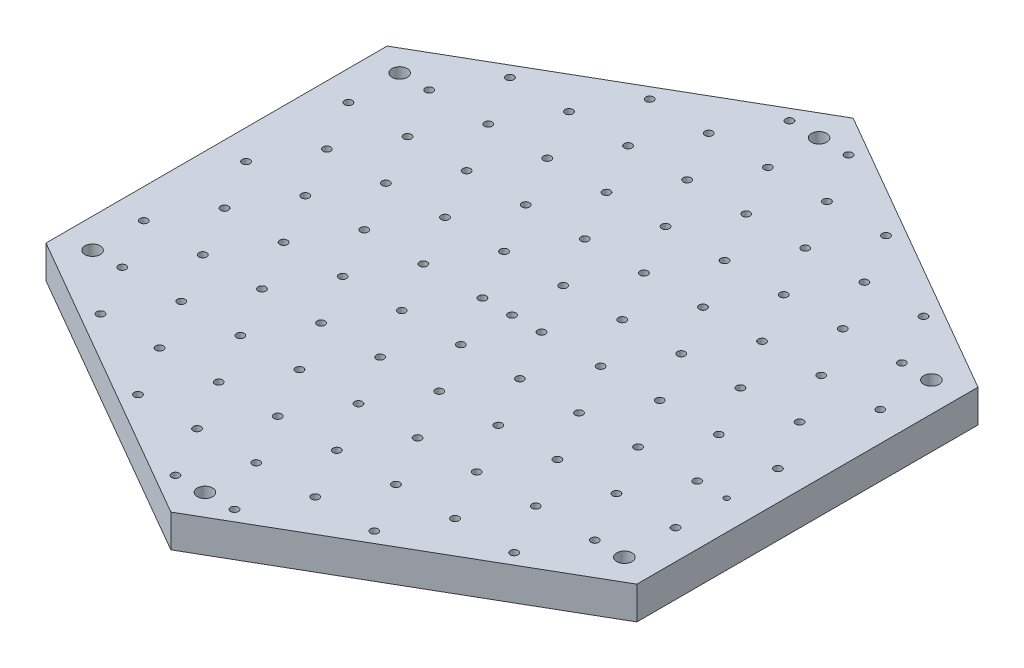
from build123d import *

# Parameters (mm, degrees)
BOSS_EXTRUDE1_DEPTH   = 6
SKETCH2_R             = 0.7
CUT_EXTRUDE1_DEPTH    = 83.897150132
BOSS_EXTRUDE2_DEPTH   = 0.34
BOSS_EXTRUDE3_DEPTH   = 0.34
BOSS_EXTRUDE4_DEPTH   = 0.34
SKETCH4_R             = 1.4
CUT_EXTRUDE3_DEPTH    = 83.897150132
SKETCH8_R             = 0.7
CUT_EXTRUDE4_DEPTH    = 83.897150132
SKETCH9_R             = 0.7
CUT_EXTRUDE5_DEPTH    = 83.897150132
SKETCH10_R            = 0.7
CUT_EXTRUDE6_DEPTH    = 83.897150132
SKETCH11_R            = 0.7
CUT_EXTRUDE7_DEPTH    = 83.897150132
SKETCH12_R            = 0.7
CUT_EXTRUDE8_DEPTH    = 83.897150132
SKETCH13_R            = 0.7
CUT_EXTRUDE9_DEPTH    = 83.897150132
SKETCH14_R            = 0.7
CUT_EXTRUDE10_DEPTH   = 83.897150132
SKETCH15_R            = 0.7
CUT_EXTRUDE11_DEPTH   = 83.897150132
SKETCH16_R            = 0.7
CUT_EXTRUDE12_DEPTH   = 83.897150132
SKETCH17_R            = 0.7
CUT_EXTRUDE13_DEPTH   = 83.897150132
LPATTERN3_COUNT       = 5
LPATTERN3_PITCH       = 10.8253
LPATTERN3_COL_COUNT   = 6
LPATTERN3_COL_PITCH   = 10.8253
LPATTERN4_COUNT       = 6
LPATTERN4_PITCH       = 10.8253
LPATTERN4_COL_COUNT   = 5
LPATTERN4_COL_PITCH   = 10.8253
LPATTERN5_COUNT       = 4
LPATTERN5_PITCH       = 10.8253
LPATTERN5_COL_COUNT   = 7
LPATTERN5_COL_PITCH   = 10.8253
LPATTERN6_COUNT       = 3
LPATTERN6_PITCH       = 10.8253
LPATTERN6_COL_COUNT   = 7
LPATTERN6_COL_PITCH   = 10.8253
LPATTERN7_COUNT       = 6
LPATTERN7_PITCH       = 10.8253
LPATTERN8_COUNT       = 5
LPATTERN8_PITCH       = 10.8253
LPATTERN9_COUNT       = 5
LPATTERN9_PITCH       = 10.8253
LPATTERN9_COL_COUNT   = 2
LPATTERN9_COL_PITCH   = 10.8253
LPATTERN10_COUNT      = 4
LPATTERN10_PITCH      = 10.8253
LPATTERN10_COL_COUNT  = 3
LPATTERN10_COL_PITCH  = 10.8253
LPATTERN11_COUNT      = 4
LPATTERN11_PITCH      = 10.8253
LPATTERN11_COL_COUNT  = 3
LPATTERN11_COL_PITCH  = 10.8253
LPATTERN12_COUNT      = 5
LPATTERN12_PITCH      = 10.8253
LPATTERN13_COUNT      = 6
LPATTERN13_PITCH      = 10.8253
LPATTERN14_COUNT      = 6
LPATTERN14_PITCH      = 10.8253
LPATTERN14_COUNT_DIR2 = 5
LPATTERN14_PITCH_DIR2 = 10.8253
LPATTERN15_COUNT      = 7
LPATTERN15_PITCH      = 10.8253
LPATTERN15_COUNT_DIR2 = 4
LPATTERN15_PITCH_DIR2 = 10.8253
LPATTERN16_COUNT      = 7
LPATTERN16_PITCH      = 10.8253
LPATTERN16_COUNT_DIR2 = 3
LPATTERN16_PITCH_DIR2 = 10.8253
LPATTERN17_COUNT      = 6
LPATTERN17_PITCH      = 10.8253
LPATTERN18_COUNT      = 5
LPATTERN18_PITCH      = 10.8253
LPATTERN19_COUNT      = 4
LPATTERN19_PITCH      = 10.8253
LPATTERN20_COUNT      = 3
LPATTERN20_PITCH      = 10.8253
SKETCH18_R            = 0.5
CUT_EXTRUDE14_DEPTH   = 83.897150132


with BuildPart() as part:
    # Sketch1 → Boss-Extrude1 (new body)
    with BuildSketch(Plane(origin=(0, 0, 0), x_dir=(1, 0, 0), z_dir=(0, 1, 0))):
        Polygon((0, 62.5), (-54.126587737, 31.25), (-54.126587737, -31.25), (0, -62.5), (54.126587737, -31.25), (54.126587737, 31.25), align=None)
    extrude(amount=BOSS_EXTRUDE1_DEPTH)

    # Sketch2 → Cut-Extrude1 (cut, through all)
    with BuildSketch(Plane(origin=(0, 6, 0), x_dir=(1, 0, 0), z_dir=(0, 1, 0))):
        with Locations(Location((0, 0, 0), (0, 0, 270))):
            Circle(SKETCH2_R)
    extrude(amount=-CUT_EXTRUDE1_DEPTH, mode=Mode.SUBTRACT)

    # Sketch5 → Boss-Extrude2 (add)
    with BuildSketch(Plane(origin=(0, 6, 0), x_dir=(1, 0, 0), z_dir=(0, 1, 0))):
        Polygon((-54.126587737, 26.862137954), (3.8, 60.306068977), (0, 62.5), (-54.126587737, 31.25), align=None)
    extrude(amount=-BOSS_EXTRUDE2_DEPTH)

    # Sketch6 → Boss-Extrude3 (add)
    with BuildSketch(Plane(origin=(0, 6, 0), x_dir=(1, 0, 0), z_dir=(0, 1, 0))):
        Polygon((54.126587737, 31.25), (54.126587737, 26.862137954), (-3.8, 60.306068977), (0, 62.5), align=None)
    extrude(amount=-BOSS_EXTRUDE3_DEPTH)

    # Sketch7 → Boss-Extrude4 (add)
    with BuildSketch(Plane(origin=(0, 6, 0), x_dir=(1, 0, 0), z_dir=(0, 1, 0))):
        Polygon((-54.126587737, -31.25), (-54.126587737, -26.862137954), (0, -58.112137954), (54.126587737, -26.862137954), (54.126587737, -31.25), (0, -62.5), align=None)
    extrude(amount=-BOSS_EXTRUDE4_DEPTH)

    # Sketch4 → Cut-Extrude3 (cut, through all)
    with BuildSketch(Plane(origin=(0, 6, 0), x_dir=(1, 0, 0), z_dir=(0, 1, 0))):
        with Locations(Location((0, 56.253070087, 0), (0, 0, 270))):
            Circle(SKETCH4_R)
        with Locations(Location((-48.713928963, 28.125, 0), (0, 0, 270))):
            Circle(SKETCH4_R)
        with Locations(Location((-48.716587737, -28.126535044, 0), (0, 0, 270))):
            Circle(SKETCH4_R)
        with Locations(Location((0, -56.253070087, 0), (0, 0, 270))):
            Circle(SKETCH4_R)
        with Locations(Location((48.716587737, -28.126535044, 0), (0, 0, 270))):
            Circle(SKETCH4_R)
        with Locations(Location((48.716587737, 28.126535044, 0), (0, 0, 270))):
            Circle(SKETCH4_R)
    extrude(amount=-CUT_EXTRUDE3_DEPTH, mode=Mode.SUBTRACT)

    # Sketch8 → Cut-Extrude4 (cut, through all)
    with BuildSketch(Plane(origin=(0, 6, 0), x_dir=(1, 0, 0), z_dir=(0, 1, 0))):
        with Locations(Location((5.41265, 0, 0), (0, 0, 270))):
            Circle(SKETCH8_R)
    cut_extrude4 = extrude(amount=-CUT_EXTRUDE4_DEPTH, mode=Mode.SUBTRACT)

    # Sketch9 → Cut-Extrude5 (cut, through all)
    with BuildSketch(Plane(origin=(0, 6, 0), x_dir=(1, 0, 0), z_dir=(0, 1, 0))):
        with Locations(Location((16.23795, 0, 0), (0, 0, 270))):
            Circle(SKETCH9_R)
    cut_extrude5 = extrude(amount=-CUT_EXTRUDE5_DEPTH, mode=Mode.SUBTRACT)

    # Sketch10 → Cut-Extrude6 (cut, through all)
    with BuildSketch(Plane(origin=(0, 6, 0), x_dir=(1, 0, 0), z_dir=(0, 1, 0))):
        with Locations(Location((27.06325, 0, 0), (0, 0, 270))):
            Circle(SKETCH10_R)
    cut_extrude6 = extrude(amount=-CUT_EXTRUDE6_DEPTH, mode=Mode.SUBTRACT)

    # Sketch11 → Cut-Extrude7 (cut, through all)
    with BuildSketch(Plane(origin=(0, 6, 0), x_dir=(1, 0, 0), z_dir=(0, 1, 0))):
        with Locations(Location((37.88855, 0, 0), (0, 0, 270))):
            Circle(SKETCH11_R)
    cut_extrude7 = extrude(amount=-CUT_EXTRUDE7_DEPTH, mode=Mode.SUBTRACT)

    # Sketch12 → Cut-Extrude8 (cut, through all)
    with BuildSketch(Plane(origin=(0, 6, 0), x_dir=(1, 0, 0), z_dir=(0, 1, 0))):
        with Locations(Location((48.71385, 0, 0), (0, 0, 270))):
            Circle(SKETCH12_R)
    cut_extrude8 = extrude(amount=-CUT_EXTRUDE8_DEPTH, mode=Mode.SUBTRACT)

    # Sketch13 → Cut-Extrude9 (cut, through all)
    with BuildSketch(Plane(origin=(0, 6, 0), x_dir=(1, 0, 0), z_dir=(0, 1, 0))):
        with Locations(Location((-5.41265, 0, 0), (0, 0, 270))):
            Circle(SKETCH13_R)
    cut_extrude9 = extrude(amount=-CUT_EXTRUDE9_DEPTH, mode=Mode.SUBTRACT)

    # Sketch14 → Cut-Extrude10 (cut, through all)
    with BuildSketch(Plane(origin=(0, 6, 0), x_dir=(1, 0, 0), z_dir=(0, 1, 0))):
        with Locations(Location((-16.23795, 0, 0), (0, 0, 270))):
            Circle(SKETCH14_R)
    cut_extrude10 = extrude(amount=-CUT_EXTRUDE10_DEPTH, mode=Mode.SUBTRACT)

    # Sketch15 → Cut-Extrude11 (cut, through all)
    with BuildSketch(Plane(origin=(0, 6, 0), x_dir=(1, 0, 0), z_dir=(0, 1, 0))):
        with Locations(Location((-27.06325, 0, 0), (0, 0, 270))):
            Circle(SKETCH15_R)
    cut_extrude11 = extrude(amount=-CUT_EXTRUDE11_DEPTH, mode=Mode.SUBTRACT)

    # Sketch16 → Cut-Extrude12 (cut, through all)
    with BuildSketch(Plane(origin=(0, 6, 0), x_dir=(1, 0, 0), z_dir=(0, 1, 0))):
        with Locations(Location((-37.88855, 0, 0), (0, 0, 270))):
            Circle(SKETCH16_R)
    cut_extrude12 = extrude(amount=-CUT_EXTRUDE12_DEPTH, mode=Mode.SUBTRACT)

    # Sketch17 → Cut-Extrude13 (cut, through all)
    with BuildSketch(Plane(origin=(0, 6, 0), x_dir=(1, 0, 0), z_dir=(0, 1, 0))):
        with Locations(Location((-48.71385, 0, 0), (0, 0, 270))):
            Circle(SKETCH17_R)
    cut_extrude13 = extrude(amount=-CUT_EXTRUDE13_DEPTH, mode=Mode.SUBTRACT)

    # LPattern3: Cut-Extrude4 ×5
    with Locations(*[Vector(0.4999999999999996, 0, 0.8660254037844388) * (i * LPATTERN3_PITCH) for i in range(1, LPATTERN3_COUNT)]):
        add(cut_extrude4, mode=Mode.SUBTRACT)

    # LPattern3 col: Cut-Extrude4 ×6
    with Locations(*[Vector(-0.4999999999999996, 0, -0.8660254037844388) * (i * LPATTERN3_COL_PITCH) for i in range(1, LPATTERN3_COL_COUNT)]):
        add(cut_extrude4, mode=Mode.SUBTRACT)

    # LPattern4: Cut-Extrude5 ×6
    with Locations(*[Vector(-0.4999999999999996, 0, -0.8660254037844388) * (i * LPATTERN4_PITCH) for i in range(1, LPATTERN4_COUNT)]):
        add(cut_extrude5, mode=Mode.SUBTRACT)

    # LPattern4 col: Cut-Extrude5 ×5
    with Locations(*[Vector(0.4999999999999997, 0, 0.8660254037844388) * (i * LPATTERN4_COL_PITCH) for i in range(1, LPATTERN4_COL_COUNT)]):
        add(cut_extrude5, mode=Mode.SUBTRACT)

    # LPattern5: Cut-Extrude6 ×4
    with Locations(*[Vector(0.4999999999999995, 0, 0.8660254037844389) * (i * LPATTERN5_PITCH) for i in range(1, LPATTERN5_COUNT)]):
        add(cut_extrude6, mode=Mode.SUBTRACT)

    # LPattern5 col: Cut-Extrude6 ×7
    with Locations(*[Vector(-0.4999999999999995, 0, -0.8660254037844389) * (i * LPATTERN5_COL_PITCH) for i in range(1, LPATTERN5_COL_COUNT)]):
        add(cut_extrude6, mode=Mode.SUBTRACT)

    # LPattern6: Cut-Extrude7 ×3
    with Locations(*[Vector(0.4999999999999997, 0, 0.8660254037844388) * (i * LPATTERN6_PITCH) for i in range(1, LPATTERN6_COUNT)]):
        add(cut_extrude7, mode=Mode.SUBTRACT)

    # LPattern6 col: Cut-Extrude7 ×7
    with Locations(*[Vector(-0.4999999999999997, 0, -0.8660254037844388) * (i * LPATTERN6_COL_PITCH) for i in range(1, LPATTERN6_COL_COUNT)]):
        add(cut_extrude7, mode=Mode.SUBTRACT)

    # LPattern7: Cut-Extrude8 ×6
    with Locations(*[Vector(-0.4999999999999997, 0, -0.8660254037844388) * (i * LPATTERN7_PITCH) for i in range(1, LPATTERN7_COUNT)]):
        add(cut_extrude8, mode=Mode.SUBTRACT)

    # LPattern8: Cut-Extrude9 ×5
    with Locations(*[Vector(-0.4999999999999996, 0, 0.8660254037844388) * (i * LPATTERN8_PITCH) for i in range(1, LPATTERN8_COUNT)]):
        add(cut_extrude9, mode=Mode.SUBTRACT)

    # LPattern9: Cut-Extrude10 ×5
    with Locations(*[Vector(-0.4999999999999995, 0, 0.8660254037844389) * (i * LPATTERN9_PITCH) for i in range(1, LPATTERN9_COUNT)]):
        add(cut_extrude10, mode=Mode.SUBTRACT)

    # LPattern9 col: Cut-Extrude10 ×2
    with Locations(*[Vector(0.4999999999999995, 0, -0.8660254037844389) * (i * LPATTERN9_COL_PITCH) for i in range(1, LPATTERN9_COL_COUNT)]):
        add(cut_extrude10, mode=Mode.SUBTRACT)

    # LPattern10: Cut-Extrude11 ×4
    with Locations(*[Vector(-0.4999999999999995, 0, 0.8660254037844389) * (i * LPATTERN10_PITCH) for i in range(1, LPATTERN10_COUNT)]):
        add(cut_extrude11, mode=Mode.SUBTRACT)

    # LPattern10 col: Cut-Extrude11 ×3
    with Locations(*[Vector(0.4999999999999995, 0, -0.8660254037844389) * (i * LPATTERN10_COL_PITCH) for i in range(1, LPATTERN10_COL_COUNT)]):
        add(cut_extrude11, mode=Mode.SUBTRACT)

    # LPattern11: Cut-Extrude12 ×4
    with Locations(*[Vector(0.4999999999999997, 0, -0.8660254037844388) * (i * LPATTERN11_PITCH) for i in range(1, LPATTERN11_COUNT)]):
        add(cut_extrude12, mode=Mode.SUBTRACT)

    # LPattern11 col: Cut-Extrude12 ×3
    with Locations(*[Vector(-0.4999999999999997, 0, 0.8660254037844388) * (i * LPATTERN11_COL_PITCH) for i in range(1, LPATTERN11_COL_COUNT)]):
        add(cut_extrude12, mode=Mode.SUBTRACT)

    # LPattern12: Cut-Extrude13 ×5
    with Locations(*[Vector(0.4999999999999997, 0, -0.8660254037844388) * (i * LPATTERN12_PITCH) for i in range(1, LPATTERN12_COUNT)]):
        add(cut_extrude13, mode=Mode.SUBTRACT)

    # LPattern13: Cut-Extrude9 ×6
    with Locations(*[Vector(0.4999999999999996, 0, 0.8660254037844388) * (i * LPATTERN13_PITCH) for i in range(1, LPATTERN13_COUNT)]):
        add(cut_extrude9, mode=Mode.SUBTRACT)

    # LPattern14: Cut-Extrude10 6 × 5
    with Locations(*[Vector(0.4999999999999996, 0, 0.8660254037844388) * (i * LPATTERN14_PITCH) + Vector(-0.4999999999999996, 0, -0.8660254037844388) * (j * LPATTERN14_PITCH_DIR2) for i in range(LPATTERN14_COUNT) for j in range(LPATTERN14_COUNT_DIR2) if (i, j) != (0, 0)]):
        add(cut_extrude10, mode=Mode.SUBTRACT)

    # LPattern15: Cut-Extrude11 7 × 4
    with Locations(*[Vector(0.4999999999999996, 0, 0.8660254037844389) * (i * LPATTERN15_PITCH) + Vector(-0.4999999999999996, 0, -0.8660254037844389) * (j * LPATTERN15_PITCH_DIR2) for i in range(LPATTERN15_COUNT) for j in range(LPATTERN15_COUNT_DIR2) if (i, j) != (0, 0)]):
        add(cut_extrude11, mode=Mode.SUBTRACT)

    # LPattern16: Cut-Extrude12 7 × 3
    with Locations(*[Vector(0.4999999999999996, 0, 0.8660254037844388) * (i * LPATTERN16_PITCH) + Vector(-0.4999999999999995, 0, -0.8660254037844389) * (j * LPATTERN16_PITCH_DIR2) for i in range(LPATTERN16_COUNT) for j in range(LPATTERN16_COUNT_DIR2) if (i, j) != (0, 0)]):
        add(cut_extrude12, mode=Mode.SUBTRACT)

    # LPattern17: Cut-Extrude13 ×6
    with Locations(*[Vector(0.49999999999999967, 0, 0.8660254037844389) * (i * LPATTERN17_PITCH) for i in range(1, LPATTERN17_COUNT)]):
        add(cut_extrude13, mode=Mode.SUBTRACT)

    # LPattern18: Cut-Extrude5 ×5
    with Locations(*[Vector(0.4999999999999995, 0, -0.8660254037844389) * (i * LPATTERN18_PITCH) for i in range(1, LPATTERN18_COUNT)]):
        add(cut_extrude5, mode=Mode.SUBTRACT)

    # LPattern19: Cut-Extrude6 ×4
    with Locations(*[Vector(0.4999999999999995, 0, -0.866025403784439) * (i * LPATTERN19_PITCH) for i in range(1, LPATTERN19_COUNT)]):
        add(cut_extrude6, mode=Mode.SUBTRACT)

    # LPattern20: Cut-Extrude7 ×3
    with Locations(*[Vector(0.4999999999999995, 0, -0.8660254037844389) * (i * LPATTERN20_PITCH) for i in range(1, LPATTERN20_COUNT)]):
        add(cut_extrude7, mode=Mode.SUBTRACT)

    # Sketch18 → Cut-Extrude14 (cut, through all)
    with BuildSketch(Plane(origin=(0, 6, 0), x_dir=(1, 0, 0), z_dir=(0, 1, 0))):
        with Locations(Location((48.71385, -9.374984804, 0), (0, 0, 270))):
            Circle(SKETCH18_R)
    extrude(amount=-CUT_EXTRUDE14_DEPTH, mode=Mode.SUBTRACT)


solid = part.part
